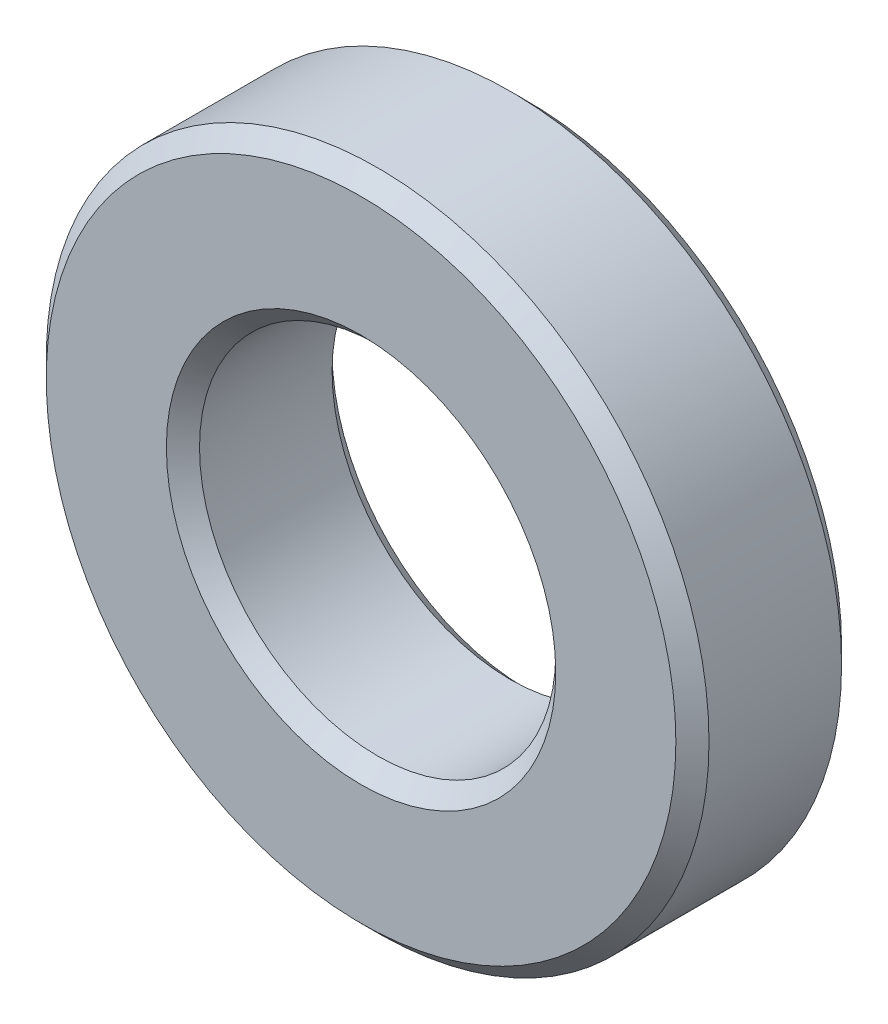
ISO-10303-21;
HEADER;
FILE_DESCRIPTION(('STEP AP214'),'2;1');
FILE_NAME('part.step','',(''),(''),'','','');
FILE_SCHEMA(('AUTOMOTIVE_DESIGN { 1 0 10303 214 1 1 1 1 }'));
ENDSEC;
DATA;
#1=APPLICATION_CONTEXT('core data for automotive mechanical design processes');
#2=APPLICATION_PROTOCOL_DEFINITION('international standard','automotive_design',2000,#1);
#3=PRODUCT_CONTEXT('',#1,'mechanical');
#4=PRODUCT('Part','Part','',(#3));
#5=PRODUCT_RELATED_PRODUCT_CATEGORY('part','',(#4));
#6=PRODUCT_DEFINITION_FORMATION('','',#4);
#7=PRODUCT_DEFINITION_CONTEXT('part definition',#1,'design');
#8=PRODUCT_DEFINITION('design','',#6,#7);
#9=PRODUCT_DEFINITION_SHAPE('','',#8);
#10=(LENGTH_UNIT() NAMED_UNIT(*) SI_UNIT(.MILLI.,.METRE.));
#11=(NAMED_UNIT(*) PLANE_ANGLE_UNIT() SI_UNIT($,.RADIAN.));
#12=(NAMED_UNIT(*) SI_UNIT($,.STERADIAN.) SOLID_ANGLE_UNIT());
#13=UNCERTAINTY_MEASURE_WITH_UNIT(LENGTH_MEASURE(1.E-05),#10,'distance_accuracy_value','');
#14=(GEOMETRIC_REPRESENTATION_CONTEXT(3) GLOBAL_UNCERTAINTY_ASSIGNED_CONTEXT((#13)) GLOBAL_UNIT_ASSIGNED_CONTEXT((#10,
#11,#12)) REPRESENTATION_CONTEXT('',''));
#15=CARTESIAN_POINT('',(0.,0.,0.));
#16=DIRECTION('',(0.,0.,1.));
#17=DIRECTION('',(1.,0.,0.));
#18=AXIS2_PLACEMENT_3D('',#15,#16,#17);
#19=CARTESIAN_POINT('',(0.,0.,1.));
#20=DIRECTION('',(0.,0.,1.));
#21=DIRECTION('',(1.,0.,0.));
#22=AXIS2_PLACEMENT_3D('',#19,#20,#21);
#23=PLANE('',#22);
#24=CARTESIAN_POINT('',(0.,0.,1.));
#25=DIRECTION('',(0.,0.,1.));
#26=DIRECTION('',(1.,0.,0.));
#27=AXIS2_PLACEMENT_3D('',#24,#25,#26);
#28=CIRCLE('',#27,2.35);
#29=CARTESIAN_POINT('',(2.35,0.,1.));
#30=VERTEX_POINT('',#29);
#31=EDGE_CURVE('E10',#30,#30,#28,.F.);
#32=ORIENTED_EDGE('',*,*,#31,.T.);
#33=EDGE_LOOP('',(#32));
#34=FACE_BOUND('',#33,.T.);
#35=CARTESIAN_POINT('',(0.,0.,1.));
#36=DIRECTION('',(0.,0.,1.));
#37=DIRECTION('',(1.,0.,0.));
#38=AXIS2_PLACEMENT_3D('',#35,#36,#37);
#39=CIRCLE('',#38,3.8);
#40=CARTESIAN_POINT('',(3.8,0.,1.));
#41=VERTEX_POINT('',#40);
#42=EDGE_CURVE('E45',#41,#41,#39,.T.);
#43=ORIENTED_EDGE('',*,*,#42,.T.);
#44=EDGE_LOOP('',(#43));
#45=FACE_BOUND('',#44,.T.);
#46=ADVANCED_FACE('F37',(#34,#45),#23,.T.);
#47=CARTESIAN_POINT('',(0.,0.,-1.));
#48=DIRECTION('',(0.,0.,1.));
#49=DIRECTION('',(1.,0.,0.));
#50=AXIS2_PLACEMENT_3D('',#47,#48,#49);
#51=PLANE('',#50);
#52=CARTESIAN_POINT('',(0.,0.,-1.));
#53=DIRECTION('',(0.,0.,1.));
#54=DIRECTION('',(1.,0.,0.));
#55=AXIS2_PLACEMENT_3D('',#52,#53,#54);
#56=CIRCLE('',#55,3.8);
#57=CARTESIAN_POINT('',(3.8,0.,-1.));
#58=VERTEX_POINT('',#57);
#59=EDGE_CURVE('E63',#58,#58,#56,.F.);
#60=ORIENTED_EDGE('',*,*,#59,.T.);
#61=EDGE_LOOP('',(#60));
#62=FACE_BOUND('',#61,.T.);
#63=CARTESIAN_POINT('',(0.,0.,-1.));
#64=DIRECTION('',(0.,0.,1.));
#65=DIRECTION('',(1.,0.,0.));
#66=AXIS2_PLACEMENT_3D('',#63,#64,#65);
#67=CIRCLE('',#66,2.35);
#68=CARTESIAN_POINT('',(2.35,0.,-1.));
#69=VERTEX_POINT('',#68);
#70=EDGE_CURVE('E66',#69,#69,#67,.T.);
#71=ORIENTED_EDGE('',*,*,#70,.T.);
#72=EDGE_LOOP('',(#71));
#73=FACE_BOUND('',#72,.T.);
#74=ADVANCED_FACE('F89',(#62,#73),#51,.F.);
#75=CARTESIAN_POINT('',(0.,0.,1.));
#76=DIRECTION('',(0.,0.,-1.));
#77=DIRECTION('',(-1.,0.,0.));
#78=AXIS2_PLACEMENT_3D('',#75,#76,#77);
#79=CYLINDRICAL_SURFACE('',#78,4.);
#80=CARTESIAN_POINT('',(0.,0.,-0.799999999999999));
#81=DIRECTION('',(0.,0.,1.));
#82=DIRECTION('',(1.,0.,0.));
#83=AXIS2_PLACEMENT_3D('',#80,#81,#82);
#84=CIRCLE('',#83,4.);
#85=CARTESIAN_POINT('',(4.,0.,-0.799999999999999));
#86=VERTEX_POINT('',#85);
#87=EDGE_CURVE('E70',#86,#86,#84,.T.);
#88=ORIENTED_EDGE('',*,*,#87,.T.);
#89=EDGE_LOOP('',(#88));
#90=FACE_BOUND('',#89,.T.);
#91=CARTESIAN_POINT('',(0.,0.,0.799999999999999));
#92=DIRECTION('',(0.,0.,1.));
#93=DIRECTION('',(1.,0.,0.));
#94=AXIS2_PLACEMENT_3D('',#91,#92,#93);
#95=CIRCLE('',#94,4.);
#96=CARTESIAN_POINT('',(4.,0.,0.799999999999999));
#97=VERTEX_POINT('',#96);
#98=EDGE_CURVE('E74',#97,#97,#95,.F.);
#99=ORIENTED_EDGE('',*,*,#98,.T.);
#100=EDGE_LOOP('',(#99));
#101=FACE_BOUND('',#100,.T.);
#102=ADVANCED_FACE('F78',(#90,#101),#79,.T.);
#103=CARTESIAN_POINT('',(0.,0.,1.));
#104=DIRECTION('',(0.,0.,-1.));
#105=DIRECTION('',(-1.,0.,0.));
#106=AXIS2_PLACEMENT_3D('',#103,#104,#105);
#107=CYLINDRICAL_SURFACE('',#106,2.15);
#108=CARTESIAN_POINT('',(0.,0.,-0.800000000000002));
#109=DIRECTION('',(0.,0.,1.));
#110=DIRECTION('',(1.,0.,0.));
#111=AXIS2_PLACEMENT_3D('',#108,#109,#110);
#112=CIRCLE('',#111,2.15);
#113=CARTESIAN_POINT('',(2.15,0.,-0.800000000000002));
#114=VERTEX_POINT('',#113);
#115=EDGE_CURVE('E51',#114,#114,#112,.F.);
#116=ORIENTED_EDGE('',*,*,#115,.T.);
#117=EDGE_LOOP('',(#116));
#118=FACE_BOUND('',#117,.T.);
#119=CARTESIAN_POINT('',(0.,0.,0.8));
#120=DIRECTION('',(0.,0.,1.));
#121=DIRECTION('',(1.,0.,0.));
#122=AXIS2_PLACEMENT_3D('',#119,#120,#121);
#123=CIRCLE('',#122,2.15);
#124=CARTESIAN_POINT('',(2.15,0.,0.8));
#125=VERTEX_POINT('',#124);
#126=EDGE_CURVE('E57',#125,#125,#123,.T.);
#127=ORIENTED_EDGE('',*,*,#126,.T.);
#128=EDGE_LOOP('',(#127));
#129=FACE_BOUND('',#128,.T.);
#130=ADVANCED_FACE('F97',(#118,#129),#107,.F.);
#131=CARTESIAN_POINT('',(0.,0.,-0.799999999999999));
#132=DIRECTION('',(0.,0.,1.));
#133=DIRECTION('',(1.,0.,0.));
#134=AXIS2_PLACEMENT_3D('',#131,#132,#133);
#135=CONICAL_SURFACE('',#134,4.,0.785398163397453);
#136=ORIENTED_EDGE('',*,*,#59,.F.);
#137=EDGE_LOOP('',(#136));
#138=FACE_BOUND('',#137,.T.);
#139=ORIENTED_EDGE('',*,*,#87,.F.);
#140=EDGE_LOOP('',(#139));
#141=FACE_BOUND('',#140,.T.);
#142=ADVANCED_FACE('F102',(#138,#141),#135,.T.);
#143=CARTESIAN_POINT('',(0.,0.,-1.));
#144=DIRECTION('',(0.,0.,-1.));
#145=DIRECTION('',(-1.,0.,0.));
#146=AXIS2_PLACEMENT_3D('',#143,#144,#145);
#147=CONICAL_SURFACE('',#146,2.35,0.785398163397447);
#148=ORIENTED_EDGE('',*,*,#115,.F.);
#149=EDGE_LOOP('',(#148));
#150=FACE_BOUND('',#149,.T.);
#151=ORIENTED_EDGE('',*,*,#70,.F.);
#152=EDGE_LOOP('',(#151));
#153=FACE_BOUND('',#152,.T.);
#154=ADVANCED_FACE('F86',(#150,#153),#147,.F.);
#155=CARTESIAN_POINT('',(0.,0.,0.8));
#156=DIRECTION('',(0.,0.,1.));
#157=DIRECTION('',(1.,0.,0.));
#158=AXIS2_PLACEMENT_3D('',#155,#156,#157);
#159=CONICAL_SURFACE('',#158,2.15,0.785398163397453);
#160=CARTESIAN_POINT('',(2.35,0.,1.));
#161=CARTESIAN_POINT('',(2.34791666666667,0.,0.997916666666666));
#162=CARTESIAN_POINT('',(2.34583333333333,0.,0.995833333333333));
#163=CARTESIAN_POINT('',(2.34166666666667,0.,0.991666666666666));
#164=CARTESIAN_POINT('',(2.33958333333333,0.,0.989583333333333));
#165=CARTESIAN_POINT('',(2.33541666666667,0.,0.985416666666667));
#166=CARTESIAN_POINT('',(2.33333333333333,0.,0.983333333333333));
#167=CARTESIAN_POINT('',(2.32916666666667,0.,0.979166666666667));
#168=CARTESIAN_POINT('',(2.32708333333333,0.,0.977083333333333));
#169=CARTESIAN_POINT('',(2.32291666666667,0.,0.972916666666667));
#170=CARTESIAN_POINT('',(2.32083333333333,0.,0.970833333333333));
#171=CARTESIAN_POINT('',(2.31666666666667,0.,0.966666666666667));
#172=CARTESIAN_POINT('',(2.31458333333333,0.,0.964583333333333));
#173=CARTESIAN_POINT('',(2.31041666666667,0.,0.960416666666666));
#174=CARTESIAN_POINT('',(2.30833333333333,0.,0.958333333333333));
#175=CARTESIAN_POINT('',(2.30416666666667,0.,0.954166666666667));
#176=CARTESIAN_POINT('',(2.30208333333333,0.,0.952083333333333));
#177=CARTESIAN_POINT('',(2.29791666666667,0.,0.947916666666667));
#178=CARTESIAN_POINT('',(2.29583333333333,0.,0.945833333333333));
#179=CARTESIAN_POINT('',(2.29166666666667,0.,0.941666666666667));
#180=CARTESIAN_POINT('',(2.28958333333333,0.,0.939583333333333));
#181=CARTESIAN_POINT('',(2.28541666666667,0.,0.935416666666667));
#182=CARTESIAN_POINT('',(2.28333333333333,0.,0.933333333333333));
#183=CARTESIAN_POINT('',(2.27916666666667,0.,0.929166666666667));
#184=CARTESIAN_POINT('',(2.27708333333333,0.,0.927083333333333));
#185=CARTESIAN_POINT('',(2.27291666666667,0.,0.922916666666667));
#186=CARTESIAN_POINT('',(2.27083333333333,0.,0.920833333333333));
#187=CARTESIAN_POINT('',(2.26666666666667,0.,0.916666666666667));
#188=CARTESIAN_POINT('',(2.26458333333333,0.,0.914583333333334));
#189=CARTESIAN_POINT('',(2.26041666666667,0.,0.910416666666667));
#190=CARTESIAN_POINT('',(2.25833333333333,0.,0.908333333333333));
#191=CARTESIAN_POINT('',(2.25416666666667,0.,0.904166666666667));
#192=CARTESIAN_POINT('',(2.25208333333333,0.,0.902083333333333));
#193=CARTESIAN_POINT('',(2.24791666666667,0.,0.897916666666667));
#194=CARTESIAN_POINT('',(2.24583333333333,0.,0.895833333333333));
#195=CARTESIAN_POINT('',(2.24166666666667,0.,0.891666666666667));
#196=CARTESIAN_POINT('',(2.23958333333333,0.,0.889583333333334));
#197=CARTESIAN_POINT('',(2.23541666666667,0.,0.885416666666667));
#198=CARTESIAN_POINT('',(2.23333333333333,0.,0.883333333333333));
#199=CARTESIAN_POINT('',(2.22916666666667,0.,0.879166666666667));
#200=CARTESIAN_POINT('',(2.22708333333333,0.,0.877083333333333));
#201=CARTESIAN_POINT('',(2.22291666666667,0.,0.872916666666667));
#202=CARTESIAN_POINT('',(2.22083333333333,0.,0.870833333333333));
#203=CARTESIAN_POINT('',(2.21666666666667,0.,0.866666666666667));
#204=CARTESIAN_POINT('',(2.21458333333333,0.,0.864583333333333));
#205=CARTESIAN_POINT('',(2.21041666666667,0.,0.860416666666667));
#206=CARTESIAN_POINT('',(2.20833333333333,0.,0.858333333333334));
#207=CARTESIAN_POINT('',(2.20416666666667,0.,0.854166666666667));
#208=CARTESIAN_POINT('',(2.20208333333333,0.,0.852083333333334));
#209=CARTESIAN_POINT('',(2.19791666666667,0.,0.847916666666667));
#210=CARTESIAN_POINT('',(2.19583333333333,0.,0.845833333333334));
#211=CARTESIAN_POINT('',(2.19166666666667,0.,0.841666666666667));
#212=CARTESIAN_POINT('',(2.18958333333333,0.,0.839583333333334));
#213=CARTESIAN_POINT('',(2.18541666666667,0.,0.835416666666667));
#214=CARTESIAN_POINT('',(2.18333333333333,0.,0.833333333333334));
#215=CARTESIAN_POINT('',(2.17916666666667,0.,0.829166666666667));
#216=CARTESIAN_POINT('',(2.17708333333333,0.,0.827083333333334));
#217=CARTESIAN_POINT('',(2.17291666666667,0.,0.822916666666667));
#218=CARTESIAN_POINT('',(2.17083333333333,0.,0.820833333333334));
#219=CARTESIAN_POINT('',(2.16666666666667,0.,0.816666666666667));
#220=CARTESIAN_POINT('',(2.16458333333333,0.,0.814583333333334));
#221=CARTESIAN_POINT('',(2.16041666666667,0.,0.810416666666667));
#222=CARTESIAN_POINT('',(2.15833333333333,0.,0.808333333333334));
#223=CARTESIAN_POINT('',(2.15416666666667,0.,0.804166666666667));
#224=CARTESIAN_POINT('',(2.15208333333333,0.,0.802083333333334));
#225=CARTESIAN_POINT('',(2.15,0.,0.8));
#226=B_SPLINE_CURVE_WITH_KNOTS('',3,(#160,#161,#162,#163,#164,#165,#166,#167,#168,#169,#170,
#171,#172,#173,#174,#175,#176,#177,#178,#179,#180,#181,#182,#183,#184,#185,#186,#187,#188,#189,
#190,#191,#192,#193,#194,#195,#196,#197,#198,#199,#200,#201,#202,#203,#204,#205,#206,#207,#208,
#209,#210,#211,#212,#213,#214,#215,#216,#217,#218,#219,#220,#221,#222,#223,#224,#225),
.UNSPECIFIED.,.F.,.F.,(4,2,2,2,2,2,2,2,2,2,2,2,2,2,2,2,2,2,2,2,2,2,2,2,2,2,2,2,2,2,2,2,4),(0.,
0.00883883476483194,0.0176776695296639,0.0265165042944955,0.0353553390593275,0.0441941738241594,
0.0530330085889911,0.0618718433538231,0.070710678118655,0.0795495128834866,0.0883883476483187,
0.0972271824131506,0.106066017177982,0.114904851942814,0.123743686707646,0.132582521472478,
0.14142135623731,0.150260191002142,0.159099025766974,0.167937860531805,0.176776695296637,
0.185615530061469,0.194454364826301,0.203293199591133,0.212132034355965,0.220970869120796,
0.229809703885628,0.23864853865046,0.247487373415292,0.256326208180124,0.265165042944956,
0.274003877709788,0.28284271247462),.UNSPECIFIED.);
#227=EDGE_CURVE('BSEAM82',#30,#125,#226,.T.);
#228=ORIENTED_EDGE('',*,*,#31,.F.);
#229=ORIENTED_EDGE('',*,*,#126,.F.);
#230=ORIENTED_EDGE('',*,*,#227,.T.);
#231=ORIENTED_EDGE('',*,*,#227,.F.);
#232=EDGE_LOOP('',(#228,#230,#229,#231));
#233=FACE_BOUND('',#232,.T.);
#234=ADVANCED_FACE('F82',(#233),#159,.F.);
#235=CARTESIAN_POINT('',(0.,0.,1.));
#236=DIRECTION('',(0.,0.,-1.));
#237=DIRECTION('',(-1.,0.,0.));
#238=AXIS2_PLACEMENT_3D('',#235,#236,#237);
#239=CONICAL_SURFACE('',#238,3.8,0.785398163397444);
#240=ORIENTED_EDGE('',*,*,#98,.F.);
#241=EDGE_LOOP('',(#240));
#242=FACE_BOUND('',#241,.T.);
#243=ORIENTED_EDGE('',*,*,#42,.F.);
#244=EDGE_LOOP('',(#243));
#245=FACE_BOUND('',#244,.T.);
#246=ADVANCED_FACE('F39',(#242,#245),#239,.T.);
#247=CLOSED_SHELL('',(#46,#74,#102,#130,#142,#154,#234,#246));
#248=MANIFOLD_SOLID_BREP('B2',#247);
#249=ADVANCED_BREP_SHAPE_REPRESENTATION('',(#18,#248),#14);
#250=SHAPE_DEFINITION_REPRESENTATION(#9,#249);
ENDSEC;
END-ISO-10303-21;
